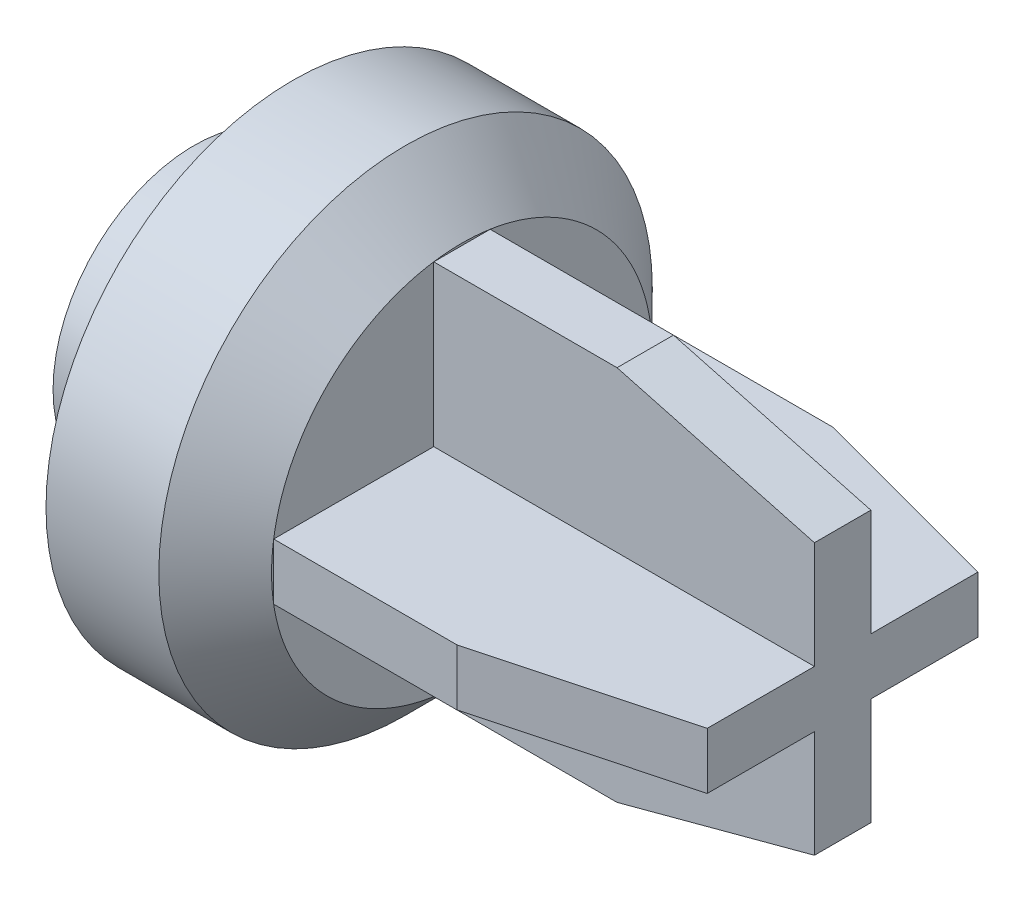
from build123d import *

# Parameters (mm, degrees)
BOSS_EXTRU_1_DEPTH           = 1
R_P_TITION_CIRCULAIRE1_COUNT = 2
R_P_TITION_CIRCULAIRE1_ANGLE = 90


with BuildPart() as part:
    # Esquisse1 → R_volution1 (revolve)
    with BuildSketch(Plane.XY, mode=Mode.PRIVATE) as r_volution1_sk:
        Polygon((-3.5, 8.75), (0.5, 8.75), (2.5, 6.75), (2.5, 0), (0, 0), (0, 3.875), (-7, 3.5), (-7, 5), (-0.5, 5.34), (-0.5, 6.75), (-3.5, 6.75), align=None)
    revolve(r_volution1_sk.sketch.rotate(Axis((0, 0, 0), (1, 0, 0)), 90), axis=Axis((0, 0, 0), (1, 0, 0)))

    # Esquisse2 → Boss.-Extru.1 (add, symmetric)
    with BuildSketch(Plane.XY):
        Polygon((2.5, 6.675), (9, 6.675), (16, 4.8), (16, -4.8), (9, -6.675), (2.5, -6.675), align=None)
    boss_extru_1 = extrude(amount=BOSS_EXTRU_1_DEPTH, both=True)

    # R_p_tition circulaire1: Boss.-Extru.1 ×2 about axis
    r_p_tition_circulaire1_axis = Axis((0, 0, 0), (-1, 0, 0))
    for i in range(1, R_P_TITION_CIRCULAIRE1_COUNT):
        add(boss_extru_1.rotate(r_p_tition_circulaire1_axis, i * R_P_TITION_CIRCULAIRE1_ANGLE / (R_P_TITION_CIRCULAIRE1_COUNT - 1)))


solid = part.part
